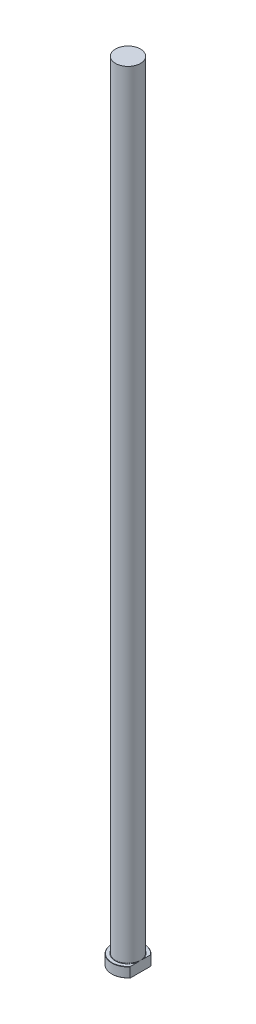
from build123d import *
from build123d.topology import SkipClean

# Parameters (mm, degrees)
CHAMFER1_SIZE = 0.2
FILLET1_R     = 0.3
KEY_DEPTH     = 631.268196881


with BuildPart() as part:
    # Sketch1 → Revolve1 (revolve)
    with BuildSketch(Plane.XY, mode=Mode.PRIVATE) as revolve1_sk:
        Polygon((0, 0), (-13, 0), (-13, 8), (-10, 8), (-10, 630), (0, 630), align=None)
    revolve(revolve1_sk.sketch.rotate(Axis((0, 259.958771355, 0), (0, -1, 0)), 270), axis=Axis((0, 259.958771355, 0), (0, -1, 0)))

    # Chamfer1
    chamfer1_edges = [part.edges().sort_by_distance(p)[0] for p in [
        (0, 8, -13),
        (0, 0, -13),
    ]]
    chamfer(chamfer1_edges, length=CHAMFER1_SIZE)

    # Fillet1
    fillet1_edges = [part.edges().sort_by_distance(p)[0] for p in [
        (0, 8, -10),
    ]]
    fillet(fillet1_edges, radius=FILLET1_R)

    # Sketch2 → KEY (cut, through all)
    with SkipClean():  # the faces are left unmerged after this step: merging them gives an invalid solid
        with BuildSketch(Plane(origin=(0, 0, 0), x_dir=(1, 0, 0), z_dir=(0, 1, 0))):
            with BuildLine():
                Line((10, 8.306623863), (10, -8.306623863))
                ThreePointArc((10, -8.306623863), (13, 0), (10, 8.306623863))
            make_face()
        extrude(amount=KEY_DEPTH, mode=Mode.SUBTRACT)


solid = part.part
